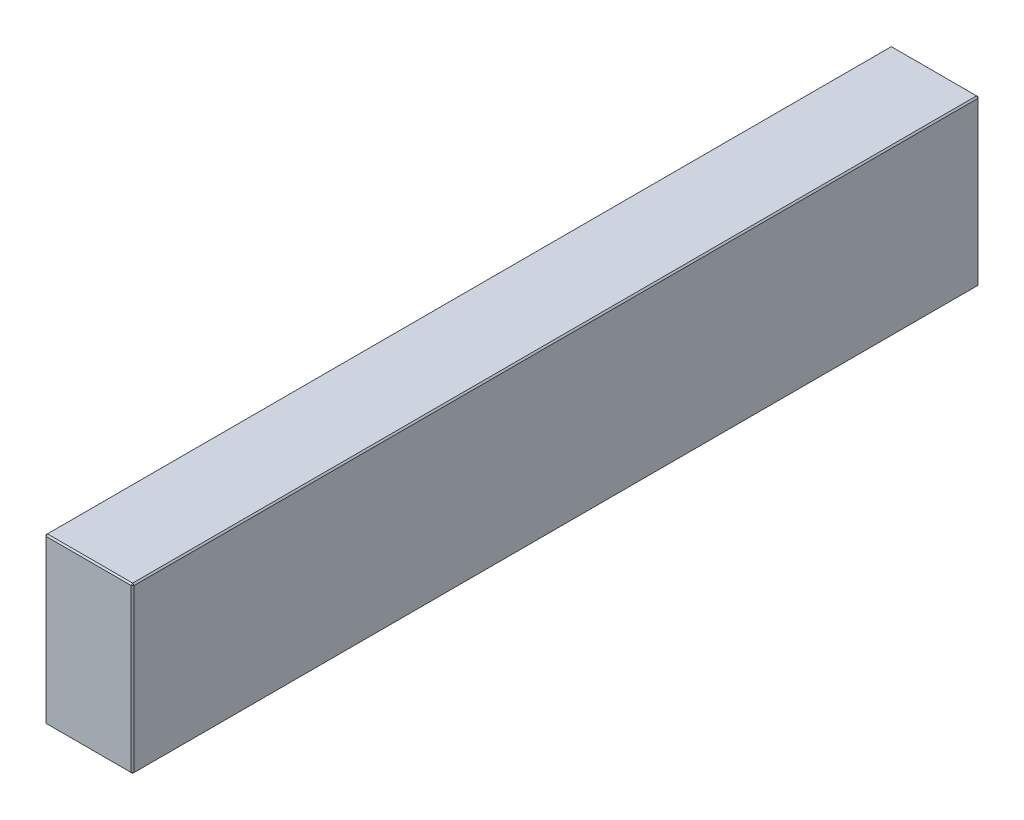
ISO-10303-21;
HEADER;
FILE_DESCRIPTION(('STEP AP214'),'2;1');
FILE_NAME('part.step','',(''),(''),'','','');
FILE_SCHEMA(('AUTOMOTIVE_DESIGN { 1 0 10303 214 1 1 1 1 }'));
ENDSEC;
DATA;
#1=APPLICATION_CONTEXT('core data for automotive mechanical design processes');
#2=APPLICATION_PROTOCOL_DEFINITION('international standard','automotive_design',2000,#1);
#3=PRODUCT_CONTEXT('',#1,'mechanical');
#4=PRODUCT('Part','Part','',(#3));
#5=PRODUCT_RELATED_PRODUCT_CATEGORY('part','',(#4));
#6=PRODUCT_DEFINITION_FORMATION('','',#4);
#7=PRODUCT_DEFINITION_CONTEXT('part definition',#1,'design');
#8=PRODUCT_DEFINITION('design','',#6,#7);
#9=PRODUCT_DEFINITION_SHAPE('','',#8);
#10=(LENGTH_UNIT() NAMED_UNIT(*) SI_UNIT(.MILLI.,.METRE.));
#11=(NAMED_UNIT(*) PLANE_ANGLE_UNIT() SI_UNIT($,.RADIAN.));
#12=(NAMED_UNIT(*) SI_UNIT($,.STERADIAN.) SOLID_ANGLE_UNIT());
#13=UNCERTAINTY_MEASURE_WITH_UNIT(LENGTH_MEASURE(1.E-05),#10,'distance_accuracy_value','');
#14=(GEOMETRIC_REPRESENTATION_CONTEXT(3) GLOBAL_UNCERTAINTY_ASSIGNED_CONTEXT((#13)) GLOBAL_UNIT_ASSIGNED_CONTEXT((#10,
#11,#12)) REPRESENTATION_CONTEXT('',''));
#15=CARTESIAN_POINT('',(0.,0.,0.));
#16=DIRECTION('',(0.,0.,1.));
#17=DIRECTION('',(1.,0.,0.));
#18=AXIS2_PLACEMENT_3D('',#15,#16,#17);
#19=CARTESIAN_POINT('',(-31.,116.,298.));
#20=DIRECTION('',(1.,0.,0.));
#21=DIRECTION('',(0.,0.,-1.));
#22=AXIS2_PLACEMENT_3D('',#19,#20,#21);
#23=PLANE('',#22);
#24=DIRECTION('',(0.,-1.,0.));
#25=VECTOR('',#24,1.);
#26=CARTESIAN_POINT('',(-31.,116.,-297.));
#27=LINE('',#26,#25);
#28=CARTESIAN_POINT('',(-31.,115.,-297.));
#29=VERTEX_POINT('',#28);
#30=CARTESIAN_POINT('',(-31.,1.,-297.));
#31=VERTEX_POINT('',#30);
#32=EDGE_CURVE('E114',#29,#31,#27,.T.);
#33=ORIENTED_EDGE('',*,*,#32,.T.);
#34=DIRECTION('',(0.,0.,1.));
#35=VECTOR('',#34,1.);
#36=CARTESIAN_POINT('',(-31.,1.,298.));
#37=LINE('',#36,#35);
#38=CARTESIAN_POINT('',(-31.,1.,297.));
#39=VERTEX_POINT('',#38);
#40=EDGE_CURVE('E110',#31,#39,#37,.T.);
#41=ORIENTED_EDGE('',*,*,#40,.T.);
#42=DIRECTION('',(0.,1.,0.));
#43=VECTOR('',#42,1.);
#44=CARTESIAN_POINT('',(-31.,116.,297.));
#45=LINE('',#44,#43);
#46=CARTESIAN_POINT('',(-31.,115.,297.));
#47=VERTEX_POINT('',#46);
#48=EDGE_CURVE('E103',#39,#47,#45,.T.);
#49=ORIENTED_EDGE('',*,*,#48,.T.);
#50=DIRECTION('',(0.,0.,-1.));
#51=VECTOR('',#50,1.);
#52=CARTESIAN_POINT('',(-31.,115.,-298.));
#53=LINE('',#52,#51);
#54=EDGE_CURVE('E107',#47,#29,#53,.T.);
#55=ORIENTED_EDGE('',*,*,#54,.T.);
#56=EDGE_LOOP('',(#33,#41,#49,#55));
#57=FACE_BOUND('',#56,.T.);
#58=ADVANCED_FACE('F15',(#57),#23,.F.);
#59=CARTESIAN_POINT('',(31.,116.,298.));
#60=DIRECTION('',(0.,0.,-1.));
#61=DIRECTION('',(-1.,0.,0.));
#62=AXIS2_PLACEMENT_3D('',#59,#60,#61);
#63=PLANE('',#62);
#64=DIRECTION('',(-1.,0.,0.));
#65=VECTOR('',#64,1.);
#66=CARTESIAN_POINT('',(-31.,115.,298.));
#67=LINE('',#66,#65);
#68=CARTESIAN_POINT('',(30.,115.,298.));
#69=VERTEX_POINT('',#68);
#70=CARTESIAN_POINT('',(-30.,115.,298.));
#71=VERTEX_POINT('',#70);
#72=EDGE_CURVE('E164',#69,#71,#67,.T.);
#73=ORIENTED_EDGE('',*,*,#72,.T.);
#74=DIRECTION('',(0.,-1.,0.));
#75=VECTOR('',#74,1.);
#76=CARTESIAN_POINT('',(-30.,116.,298.));
#77=LINE('',#76,#75);
#78=CARTESIAN_POINT('',(-30.,1.,298.));
#79=VERTEX_POINT('',#78);
#80=EDGE_CURVE('E122',#71,#79,#77,.T.);
#81=ORIENTED_EDGE('',*,*,#80,.T.);
#82=DIRECTION('',(1.,0.,0.));
#83=VECTOR('',#82,1.);
#84=CARTESIAN_POINT('',(31.,1.,298.));
#85=LINE('',#84,#83);
#86=CARTESIAN_POINT('',(30.,1.,298.));
#87=VERTEX_POINT('',#86);
#88=EDGE_CURVE('E168',#79,#87,#85,.T.);
#89=ORIENTED_EDGE('',*,*,#88,.T.);
#90=DIRECTION('',(0.,1.,0.));
#91=VECTOR('',#90,1.);
#92=CARTESIAN_POINT('',(30.,116.,298.));
#93=LINE('',#92,#91);
#94=EDGE_CURVE('E166',#87,#69,#93,.T.);
#95=ORIENTED_EDGE('',*,*,#94,.T.);
#96=EDGE_LOOP('',(#73,#81,#89,#95));
#97=FACE_BOUND('',#96,.T.);
#98=ADVANCED_FACE('F275',(#97),#63,.F.);
#99=CARTESIAN_POINT('',(31.,116.,298.));
#100=DIRECTION('',(-1.,0.,0.));
#101=DIRECTION('',(0.,0.,1.));
#102=AXIS2_PLACEMENT_3D('',#99,#100,#101);
#103=PLANE('',#102);
#104=DIRECTION('',(0.,0.,-1.));
#105=VECTOR('',#104,1.);
#106=CARTESIAN_POINT('',(31.,1.,298.));
#107=LINE('',#106,#105);
#108=CARTESIAN_POINT('',(31.,1.,297.));
#109=VERTEX_POINT('',#108);
#110=CARTESIAN_POINT('',(31.,1.,-297.));
#111=VERTEX_POINT('',#110);
#112=EDGE_CURVE('E159',#109,#111,#107,.T.);
#113=ORIENTED_EDGE('',*,*,#112,.T.);
#114=DIRECTION('',(0.,1.,0.));
#115=VECTOR('',#114,1.);
#116=CARTESIAN_POINT('',(31.,116.,-297.));
#117=LINE('',#116,#115);
#118=CARTESIAN_POINT('',(31.,115.,-297.));
#119=VERTEX_POINT('',#118);
#120=EDGE_CURVE('E161',#111,#119,#117,.T.);
#121=ORIENTED_EDGE('',*,*,#120,.T.);
#122=DIRECTION('',(0.,0.,1.));
#123=VECTOR('',#122,1.);
#124=CARTESIAN_POINT('',(31.,115.,298.));
#125=LINE('',#124,#123);
#126=CARTESIAN_POINT('',(31.,115.,297.));
#127=VERTEX_POINT('',#126);
#128=EDGE_CURVE('E155',#119,#127,#125,.T.);
#129=ORIENTED_EDGE('',*,*,#128,.T.);
#130=DIRECTION('',(0.,-1.,0.));
#131=VECTOR('',#130,1.);
#132=CARTESIAN_POINT('',(31.,116.,297.));
#133=LINE('',#132,#131);
#134=EDGE_CURVE('E157',#127,#109,#133,.T.);
#135=ORIENTED_EDGE('',*,*,#134,.T.);
#136=EDGE_LOOP('',(#113,#121,#129,#135));
#137=FACE_BOUND('',#136,.T.);
#138=ADVANCED_FACE('F254',(#137),#103,.F.);
#139=CARTESIAN_POINT('',(31.,116.,-298.));
#140=DIRECTION('',(0.,0.,1.));
#141=DIRECTION('',(1.,0.,0.));
#142=AXIS2_PLACEMENT_3D('',#139,#140,#141);
#143=PLANE('',#142);
#144=DIRECTION('',(0.,-1.,0.));
#145=VECTOR('',#144,1.);
#146=CARTESIAN_POINT('',(30.,116.,-298.));
#147=LINE('',#146,#145);
#148=CARTESIAN_POINT('',(30.,115.,-298.));
#149=VERTEX_POINT('',#148);
#150=CARTESIAN_POINT('',(30.,1.,-298.));
#151=VERTEX_POINT('',#150);
#152=EDGE_CURVE('E148',#149,#151,#147,.T.);
#153=ORIENTED_EDGE('',*,*,#152,.T.);
#154=DIRECTION('',(-1.,0.,0.));
#155=VECTOR('',#154,1.);
#156=CARTESIAN_POINT('',(31.,1.,-298.));
#157=LINE('',#156,#155);
#158=CARTESIAN_POINT('',(-30.,1.,-298.));
#159=VERTEX_POINT('',#158);
#160=EDGE_CURVE('E153',#151,#159,#157,.T.);
#161=ORIENTED_EDGE('',*,*,#160,.T.);
#162=DIRECTION('',(0.,1.,0.));
#163=VECTOR('',#162,1.);
#164=CARTESIAN_POINT('',(-30.,116.,-298.));
#165=LINE('',#164,#163);
#166=CARTESIAN_POINT('',(-30.,115.,-298.));
#167=VERTEX_POINT('',#166);
#168=EDGE_CURVE('E150',#159,#167,#165,.T.);
#169=ORIENTED_EDGE('',*,*,#168,.T.);
#170=DIRECTION('',(1.,0.,0.));
#171=VECTOR('',#170,1.);
#172=CARTESIAN_POINT('',(31.,115.,-298.));
#173=LINE('',#172,#171);
#174=EDGE_CURVE('E146',#167,#149,#173,.T.);
#175=ORIENTED_EDGE('',*,*,#174,.T.);
#176=EDGE_LOOP('',(#153,#161,#169,#175));
#177=FACE_BOUND('',#176,.T.);
#178=ADVANCED_FACE('F284',(#177),#143,.F.);
#179=CARTESIAN_POINT('',(0.,116.,0.));
#180=DIRECTION('',(0.,1.,0.));
#181=DIRECTION('',(0.,0.,1.));
#182=AXIS2_PLACEMENT_3D('',#179,#180,#181);
#183=PLANE('',#182);
#184=DIRECTION('',(0.,0.,-1.));
#185=VECTOR('',#184,1.);
#186=CARTESIAN_POINT('',(30.,116.,-298.));
#187=LINE('',#186,#185);
#188=CARTESIAN_POINT('',(30.,116.,297.));
#189=VERTEX_POINT('',#188);
#190=CARTESIAN_POINT('',(30.,116.,-297.));
#191=VERTEX_POINT('',#190);
#192=EDGE_CURVE('E24',#189,#191,#187,.T.);
#193=ORIENTED_EDGE('',*,*,#192,.T.);
#194=DIRECTION('',(-1.,0.,0.));
#195=VECTOR('',#194,1.);
#196=CARTESIAN_POINT('',(-31.,116.,-297.));
#197=LINE('',#196,#195);
#198=CARTESIAN_POINT('',(-30.,116.,-297.));
#199=VERTEX_POINT('',#198);
#200=EDGE_CURVE('E9',#191,#199,#197,.T.);
#201=ORIENTED_EDGE('',*,*,#200,.T.);
#202=DIRECTION('',(0.,0.,1.));
#203=VECTOR('',#202,1.);
#204=CARTESIAN_POINT('',(-30.,116.,298.));
#205=LINE('',#204,#203);
#206=CARTESIAN_POINT('',(-30.,116.,297.));
#207=VERTEX_POINT('',#206);
#208=EDGE_CURVE('E180',#199,#207,#205,.T.);
#209=ORIENTED_EDGE('',*,*,#208,.T.);
#210=DIRECTION('',(1.,0.,0.));
#211=VECTOR('',#210,1.);
#212=CARTESIAN_POINT('',(31.,116.,297.));
#213=LINE('',#212,#211);
#214=EDGE_CURVE('E35',#207,#189,#213,.T.);
#215=ORIENTED_EDGE('',*,*,#214,.T.);
#216=EDGE_LOOP('',(#193,#201,#209,#215));
#217=FACE_BOUND('',#216,.T.);
#218=ADVANCED_FACE('F350',(#217),#183,.T.);
#219=CARTESIAN_POINT('',(0.,0.,0.));
#220=DIRECTION('',(0.,1.,0.));
#221=DIRECTION('',(0.,0.,1.));
#222=AXIS2_PLACEMENT_3D('',#219,#220,#221);
#223=PLANE('',#222);
#224=DIRECTION('',(0.,0.,1.));
#225=VECTOR('',#224,1.);
#226=CARTESIAN_POINT('',(30.,0.,0.));
#227=LINE('',#226,#225);
#228=CARTESIAN_POINT('',(30.,0.,-297.));
#229=VERTEX_POINT('',#228);
#230=CARTESIAN_POINT('',(30.,0.,297.));
#231=VERTEX_POINT('',#230);
#232=EDGE_CURVE('E171',#229,#231,#227,.T.);
#233=ORIENTED_EDGE('',*,*,#232,.T.);
#234=DIRECTION('',(-1.,0.,0.));
#235=VECTOR('',#234,1.);
#236=CARTESIAN_POINT('',(0.,0.,297.));
#237=LINE('',#236,#235);
#238=CARTESIAN_POINT('',(-30.,0.,297.));
#239=VERTEX_POINT('',#238);
#240=EDGE_CURVE('E177',#231,#239,#237,.T.);
#241=ORIENTED_EDGE('',*,*,#240,.T.);
#242=DIRECTION('',(0.,0.,-1.));
#243=VECTOR('',#242,1.);
#244=CARTESIAN_POINT('',(-30.,0.,0.));
#245=LINE('',#244,#243);
#246=CARTESIAN_POINT('',(-30.,0.,-297.));
#247=VERTEX_POINT('',#246);
#248=EDGE_CURVE('E175',#239,#247,#245,.T.);
#249=ORIENTED_EDGE('',*,*,#248,.T.);
#250=DIRECTION('',(1.,0.,0.));
#251=VECTOR('',#250,1.);
#252=CARTESIAN_POINT('',(0.,0.,-297.));
#253=LINE('',#252,#251);
#254=EDGE_CURVE('E173',#247,#229,#253,.T.);
#255=ORIENTED_EDGE('',*,*,#254,.T.);
#256=EDGE_LOOP('',(#233,#241,#249,#255));
#257=FACE_BOUND('',#256,.T.);
#258=ADVANCED_FACE('F246',(#257),#223,.F.);
#259=CARTESIAN_POINT('',(31.,116.,297.));
#260=DIRECTION('',(-0.707106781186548,0.,-0.707106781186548));
#261=DIRECTION('',(0.,-1.,0.));
#262=AXIS2_PLACEMENT_3D('',#259,#260,#261);
#263=PLANE('',#262);
#264=DIRECTION('',(-0.707106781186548,0.,0.707106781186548));
#265=VECTOR('',#264,1.);
#266=CARTESIAN_POINT('',(30.,115.,298.));
#267=LINE('',#266,#265);
#268=EDGE_CURVE('E19',#69,#127,#267,.F.);
#269=ORIENTED_EDGE('',*,*,#268,.F.);
#270=ORIENTED_EDGE('',*,*,#94,.F.);
#271=DIRECTION('',(0.707106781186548,0.,-0.707106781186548));
#272=VECTOR('',#271,1.);
#273=CARTESIAN_POINT('',(30.,1.,298.));
#274=LINE('',#273,#272);
#275=EDGE_CURVE('E142',#109,#87,#274,.F.);
#276=ORIENTED_EDGE('',*,*,#275,.F.);
#277=ORIENTED_EDGE('',*,*,#134,.F.);
#278=EDGE_LOOP('',(#269,#270,#276,#277));
#279=FACE_BOUND('',#278,.T.);
#280=ADVANCED_FACE('F17',(#279),#263,.F.);
#281=CARTESIAN_POINT('',(30.,115.,298.));
#282=DIRECTION('',(0.577350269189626,0.577350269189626,0.577350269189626));
#283=DIRECTION('',(0.707106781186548,0.,-0.707106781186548));
#284=AXIS2_PLACEMENT_3D('',#281,#282,#283);
#285=PLANE('',#284);
#286=DIRECTION('',(0.,-0.707106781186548,0.707106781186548));
#287=VECTOR('',#286,1.);
#288=CARTESIAN_POINT('',(30.,115.,298.));
#289=LINE('',#288,#287);
#290=EDGE_CURVE('E226',#69,#189,#289,.F.);
#291=ORIENTED_EDGE('',*,*,#290,.F.);
#292=ORIENTED_EDGE('',*,*,#268,.T.);
#293=DIRECTION('',(-0.707106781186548,0.707106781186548,0.));
#294=VECTOR('',#293,1.);
#295=CARTESIAN_POINT('',(30.5,115.5,297.));
#296=LINE('',#295,#294);
#297=EDGE_CURVE('E228',#189,#127,#296,.F.);
#298=ORIENTED_EDGE('',*,*,#297,.F.);
#299=EDGE_LOOP('',(#291,#292,#298));
#300=FACE_BOUND('',#299,.T.);
#301=ADVANCED_FACE('F270',(#300),#285,.T.);
#302=CARTESIAN_POINT('',(30.,1.,298.));
#303=DIRECTION('',(0.577350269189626,-0.577350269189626,0.577350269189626));
#304=DIRECTION('',(0.707106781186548,0.,-0.707106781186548));
#305=AXIS2_PLACEMENT_3D('',#302,#303,#304);
#306=PLANE('',#305);
#307=DIRECTION('',(-0.707106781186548,-0.707106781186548,0.));
#308=VECTOR('',#307,1.);
#309=CARTESIAN_POINT('',(30.5,0.5,297.));
#310=LINE('',#309,#308);
#311=EDGE_CURVE('E220',#109,#231,#310,.T.);
#312=ORIENTED_EDGE('',*,*,#311,.F.);
#313=ORIENTED_EDGE('',*,*,#275,.T.);
#314=DIRECTION('',(0.,0.707106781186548,0.707106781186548));
#315=VECTOR('',#314,1.);
#316=CARTESIAN_POINT('',(30.,1.,298.));
#317=LINE('',#316,#315);
#318=EDGE_CURVE('E223',#231,#87,#317,.T.);
#319=ORIENTED_EDGE('',*,*,#318,.F.);
#320=EDGE_LOOP('',(#312,#313,#319));
#321=FACE_BOUND('',#320,.T.);
#322=ADVANCED_FACE('F235',(#321),#306,.T.);
#323=CARTESIAN_POINT('',(30.,116.,0.));
#324=DIRECTION('',(0.707106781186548,0.707106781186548,0.));
#325=DIRECTION('',(0.,0.,1.));
#326=AXIS2_PLACEMENT_3D('',#323,#324,#325);
#327=PLANE('',#326);
#328=ORIENTED_EDGE('',*,*,#297,.T.);
#329=ORIENTED_EDGE('',*,*,#128,.F.);
#330=DIRECTION('',(0.707106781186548,-0.707106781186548,0.));
#331=VECTOR('',#330,1.);
#332=CARTESIAN_POINT('',(31.,115.,-297.));
#333=LINE('',#332,#331);
#334=EDGE_CURVE('E215',#191,#119,#333,.T.);
#335=ORIENTED_EDGE('',*,*,#334,.F.);
#336=ORIENTED_EDGE('',*,*,#192,.F.);
#337=EDGE_LOOP('',(#328,#329,#335,#336));
#338=FACE_BOUND('',#337,.T.);
#339=ADVANCED_FACE('F265',(#338),#327,.T.);
#340=CARTESIAN_POINT('',(0.,116.,297.));
#341=DIRECTION('',(0.,0.707106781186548,0.707106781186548));
#342=DIRECTION('',(-1.,0.,0.));
#343=AXIS2_PLACEMENT_3D('',#340,#341,#342);
#344=PLANE('',#343);
#345=ORIENTED_EDGE('',*,*,#290,.T.);
#346=ORIENTED_EDGE('',*,*,#214,.F.);
#347=DIRECTION('',(0.,0.707106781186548,-0.707106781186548));
#348=VECTOR('',#347,1.);
#349=CARTESIAN_POINT('',(-30.,115.5,297.5));
#350=LINE('',#349,#348);
#351=EDGE_CURVE('E126',#71,#207,#350,.T.);
#352=ORIENTED_EDGE('',*,*,#351,.F.);
#353=ORIENTED_EDGE('',*,*,#72,.F.);
#354=EDGE_LOOP('',(#345,#346,#352,#353));
#355=FACE_BOUND('',#354,.T.);
#356=ADVANCED_FACE('F273',(#355),#344,.T.);
#357=CARTESIAN_POINT('',(-30.,116.,298.));
#358=DIRECTION('',(0.707106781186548,0.,-0.707106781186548));
#359=DIRECTION('',(0.,-1.,0.));
#360=AXIS2_PLACEMENT_3D('',#357,#358,#359);
#361=PLANE('',#360);
#362=DIRECTION('',(0.707106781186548,0.,0.707106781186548));
#363=VECTOR('',#362,1.);
#364=CARTESIAN_POINT('',(-30.,1.,298.));
#365=LINE('',#364,#363);
#366=EDGE_CURVE('E127',#79,#39,#365,.F.);
#367=ORIENTED_EDGE('',*,*,#366,.F.);
#368=ORIENTED_EDGE('',*,*,#80,.F.);
#369=DIRECTION('',(-0.707106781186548,0.,-0.707106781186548));
#370=VECTOR('',#369,1.);
#371=CARTESIAN_POINT('',(-31.,115.,297.));
#372=LINE('',#371,#370);
#373=EDGE_CURVE('E118',#47,#71,#372,.F.);
#374=ORIENTED_EDGE('',*,*,#373,.F.);
#375=ORIENTED_EDGE('',*,*,#48,.F.);
#376=EDGE_LOOP('',(#367,#368,#374,#375));
#377=FACE_BOUND('',#376,.T.);
#378=ADVANCED_FACE('F120',(#377),#361,.F.);
#379=CARTESIAN_POINT('',(31.,1.,298.));
#380=DIRECTION('',(0.,0.707106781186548,-0.707106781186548));
#381=DIRECTION('',(1.,0.,0.));
#382=AXIS2_PLACEMENT_3D('',#379,#380,#381);
#383=PLANE('',#382);
#384=ORIENTED_EDGE('',*,*,#318,.T.);
#385=ORIENTED_EDGE('',*,*,#88,.F.);
#386=DIRECTION('',(0.,-0.707106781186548,-0.707106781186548));
#387=VECTOR('',#386,1.);
#388=CARTESIAN_POINT('',(-30.,1.,298.));
#389=LINE('',#388,#387);
#390=EDGE_CURVE('E211',#239,#79,#389,.F.);
#391=ORIENTED_EDGE('',*,*,#390,.F.);
#392=ORIENTED_EDGE('',*,*,#240,.F.);
#393=EDGE_LOOP('',(#384,#385,#391,#392));
#394=FACE_BOUND('',#393,.T.);
#395=ADVANCED_FACE('F243',(#394),#383,.F.);
#396=CARTESIAN_POINT('',(31.,1.,298.));
#397=DIRECTION('',(-0.707106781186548,0.707106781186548,0.));
#398=DIRECTION('',(0.,0.,-1.));
#399=AXIS2_PLACEMENT_3D('',#396,#397,#398);
#400=PLANE('',#399);
#401=ORIENTED_EDGE('',*,*,#311,.T.);
#402=ORIENTED_EDGE('',*,*,#232,.F.);
#403=DIRECTION('',(0.707106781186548,0.707106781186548,0.));
#404=VECTOR('',#403,1.);
#405=CARTESIAN_POINT('',(30.5,0.499999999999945,-297.));
#406=LINE('',#405,#404);
#407=EDGE_CURVE('E208',#111,#229,#406,.F.);
#408=ORIENTED_EDGE('',*,*,#407,.F.);
#409=ORIENTED_EDGE('',*,*,#112,.F.);
#410=EDGE_LOOP('',(#401,#402,#408,#409));
#411=FACE_BOUND('',#410,.T.);
#412=ADVANCED_FACE('F251',(#411),#400,.F.);
#413=CARTESIAN_POINT('',(30.,116.,-298.));
#414=DIRECTION('',(-0.707106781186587,0.,0.707106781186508));
#415=DIRECTION('',(0.,-1.,0.));
#416=AXIS2_PLACEMENT_3D('',#413,#414,#415);
#417=PLANE('',#416);
#418=DIRECTION('',(0.707106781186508,0.,0.707106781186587));
#419=VECTOR('',#418,1.);
#420=CARTESIAN_POINT('',(31.,115.,-297.));
#421=LINE('',#420,#419);
#422=EDGE_CURVE('E217',#119,#149,#421,.F.);
#423=ORIENTED_EDGE('',*,*,#422,.F.);
#424=ORIENTED_EDGE('',*,*,#120,.F.);
#425=DIRECTION('',(-0.707106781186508,0.,-0.707106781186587));
#426=VECTOR('',#425,1.);
#427=CARTESIAN_POINT('',(30.,1.,-298.));
#428=LINE('',#427,#426);
#429=EDGE_CURVE('E205',#151,#111,#428,.F.);
#430=ORIENTED_EDGE('',*,*,#429,.F.);
#431=ORIENTED_EDGE('',*,*,#152,.F.);
#432=EDGE_LOOP('',(#423,#424,#430,#431));
#433=FACE_BOUND('',#432,.T.);
#434=ADVANCED_FACE('F258',(#433),#417,.F.);
#435=CARTESIAN_POINT('',(31.,115.,-297.));
#436=DIRECTION('',(0.577350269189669,0.577350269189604,-0.577350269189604));
#437=DIRECTION('',(-0.707106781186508,0.,-0.707106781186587));
#438=AXIS2_PLACEMENT_3D('',#435,#436,#437);
#439=PLANE('',#438);
#440=ORIENTED_EDGE('',*,*,#334,.T.);
#441=ORIENTED_EDGE('',*,*,#422,.T.);
#442=DIRECTION('',(0.,0.707106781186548,0.707106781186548));
#443=VECTOR('',#442,1.);
#444=CARTESIAN_POINT('',(30.,115.5,-297.5));
#445=LINE('',#444,#443);
#446=EDGE_CURVE('E134',#191,#149,#445,.F.);
#447=ORIENTED_EDGE('',*,*,#446,.F.);
#448=EDGE_LOOP('',(#440,#441,#447));
#449=FACE_BOUND('',#448,.T.);
#450=ADVANCED_FACE('F325',(#449),#439,.T.);
#451=CARTESIAN_POINT('',(-31.,115.,297.));
#452=DIRECTION('',(-0.577350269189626,0.577350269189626,0.577350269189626));
#453=DIRECTION('',(0.707106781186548,0.,0.707106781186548));
#454=AXIS2_PLACEMENT_3D('',#451,#452,#453);
#455=PLANE('',#454);
#456=ORIENTED_EDGE('',*,*,#373,.T.);
#457=ORIENTED_EDGE('',*,*,#351,.T.);
#458=DIRECTION('',(-0.707106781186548,-0.707106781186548,0.));
#459=VECTOR('',#458,1.);
#460=CARTESIAN_POINT('',(-31.,115.,297.));
#461=LINE('',#460,#459);
#462=EDGE_CURVE('E130',#47,#207,#461,.F.);
#463=ORIENTED_EDGE('',*,*,#462,.F.);
#464=EDGE_LOOP('',(#456,#457,#463));
#465=FACE_BOUND('',#464,.T.);
#466=ADVANCED_FACE('F131',(#465),#455,.T.);
#467=CARTESIAN_POINT('',(-30.,1.,298.));
#468=DIRECTION('',(-0.577350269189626,-0.577350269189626,0.577350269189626));
#469=DIRECTION('',(0.707106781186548,0.,0.707106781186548));
#470=AXIS2_PLACEMENT_3D('',#467,#468,#469);
#471=PLANE('',#470);
#472=ORIENTED_EDGE('',*,*,#390,.T.);
#473=ORIENTED_EDGE('',*,*,#366,.T.);
#474=DIRECTION('',(-0.707106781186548,0.707106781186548,0.));
#475=VECTOR('',#474,1.);
#476=CARTESIAN_POINT('',(-30.5,0.5,297.));
#477=LINE('',#476,#475);
#478=EDGE_CURVE('E135',#239,#39,#477,.T.);
#479=ORIENTED_EDGE('',*,*,#478,.F.);
#480=EDGE_LOOP('',(#472,#473,#479));
#481=FACE_BOUND('',#480,.T.);
#482=ADVANCED_FACE('F318',(#481),#471,.T.);
#483=CARTESIAN_POINT('',(30.,1.,-298.));
#484=DIRECTION('',(0.577350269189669,-0.577350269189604,-0.577350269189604));
#485=DIRECTION('',(-0.707106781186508,0.,-0.707106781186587));
#486=AXIS2_PLACEMENT_3D('',#483,#484,#485);
#487=PLANE('',#486);
#488=ORIENTED_EDGE('',*,*,#429,.T.);
#489=ORIENTED_EDGE('',*,*,#407,.T.);
#490=DIRECTION('',(0.,-0.707106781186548,0.707106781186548));
#491=VECTOR('',#490,1.);
#492=CARTESIAN_POINT('',(30.,1.,-298.));
#493=LINE('',#492,#491);
#494=EDGE_CURVE('E198',#151,#229,#493,.T.);
#495=ORIENTED_EDGE('',*,*,#494,.F.);
#496=EDGE_LOOP('',(#488,#489,#495));
#497=FACE_BOUND('',#496,.T.);
#498=ADVANCED_FACE('F314',(#497),#487,.T.);
#499=CARTESIAN_POINT('',(0.,116.,-297.));
#500=DIRECTION('',(0.,0.707106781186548,-0.707106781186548));
#501=DIRECTION('',(1.,0.,0.));
#502=AXIS2_PLACEMENT_3D('',#499,#500,#501);
#503=PLANE('',#502);
#504=ORIENTED_EDGE('',*,*,#446,.T.);
#505=ORIENTED_EDGE('',*,*,#174,.F.);
#506=DIRECTION('',(0.,-0.707106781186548,-0.707106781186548));
#507=VECTOR('',#506,1.);
#508=CARTESIAN_POINT('',(-30.,115.,-298.));
#509=LINE('',#508,#507);
#510=EDGE_CURVE('E195',#199,#167,#509,.T.);
#511=ORIENTED_EDGE('',*,*,#510,.F.);
#512=ORIENTED_EDGE('',*,*,#200,.F.);
#513=EDGE_LOOP('',(#504,#505,#511,#512));
#514=FACE_BOUND('',#513,.T.);
#515=ADVANCED_FACE('F311',(#514),#503,.T.);
#516=CARTESIAN_POINT('',(-30.,116.,0.));
#517=DIRECTION('',(-0.707106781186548,0.707106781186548,0.));
#518=DIRECTION('',(0.,0.,-1.));
#519=AXIS2_PLACEMENT_3D('',#516,#517,#518);
#520=PLANE('',#519);
#521=ORIENTED_EDGE('',*,*,#462,.T.);
#522=ORIENTED_EDGE('',*,*,#208,.F.);
#523=DIRECTION('',(0.707106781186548,0.707106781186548,0.));
#524=VECTOR('',#523,1.);
#525=CARTESIAN_POINT('',(-30.5,115.5,-297.));
#526=LINE('',#525,#524);
#527=EDGE_CURVE('E138',#29,#199,#526,.T.);
#528=ORIENTED_EDGE('',*,*,#527,.F.);
#529=ORIENTED_EDGE('',*,*,#54,.F.);
#530=EDGE_LOOP('',(#521,#522,#528,#529));
#531=FACE_BOUND('',#530,.T.);
#532=ADVANCED_FACE('F137',(#531),#520,.T.);
#533=CARTESIAN_POINT('',(-31.,1.,298.));
#534=DIRECTION('',(0.707106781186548,0.707106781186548,0.));
#535=DIRECTION('',(0.,0.,1.));
#536=AXIS2_PLACEMENT_3D('',#533,#534,#535);
#537=PLANE('',#536);
#538=ORIENTED_EDGE('',*,*,#478,.T.);
#539=ORIENTED_EDGE('',*,*,#40,.F.);
#540=DIRECTION('',(0.707106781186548,-0.707106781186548,0.));
#541=VECTOR('',#540,1.);
#542=CARTESIAN_POINT('',(-31.,1.,-297.));
#543=LINE('',#542,#541);
#544=EDGE_CURVE('E191',#247,#31,#543,.F.);
#545=ORIENTED_EDGE('',*,*,#544,.F.);
#546=ORIENTED_EDGE('',*,*,#248,.F.);
#547=EDGE_LOOP('',(#538,#539,#545,#546));
#548=FACE_BOUND('',#547,.T.);
#549=ADVANCED_FACE('F304',(#548),#537,.F.);
#550=CARTESIAN_POINT('',(31.,1.,-298.));
#551=DIRECTION('',(0.,0.707106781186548,0.707106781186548));
#552=DIRECTION('',(-1.,0.,0.));
#553=AXIS2_PLACEMENT_3D('',#550,#551,#552);
#554=PLANE('',#553);
#555=ORIENTED_EDGE('',*,*,#494,.T.);
#556=ORIENTED_EDGE('',*,*,#254,.F.);
#557=DIRECTION('',(0.,0.707106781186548,-0.707106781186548));
#558=VECTOR('',#557,1.);
#559=CARTESIAN_POINT('',(-30.,0.499999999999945,-297.5));
#560=LINE('',#559,#558);
#561=EDGE_CURVE('E188',#159,#247,#560,.F.);
#562=ORIENTED_EDGE('',*,*,#561,.F.);
#563=ORIENTED_EDGE('',*,*,#160,.F.);
#564=EDGE_LOOP('',(#555,#556,#562,#563));
#565=FACE_BOUND('',#564,.T.);
#566=ADVANCED_FACE('F300',(#565),#554,.F.);
#567=CARTESIAN_POINT('',(-30.,115.,-298.));
#568=DIRECTION('',(-0.577350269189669,0.577350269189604,-0.577350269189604));
#569=DIRECTION('',(-0.707106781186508,0.,0.707106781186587));
#570=AXIS2_PLACEMENT_3D('',#567,#568,#569);
#571=PLANE('',#570);
#572=ORIENTED_EDGE('',*,*,#527,.T.);
#573=ORIENTED_EDGE('',*,*,#510,.T.);
#574=DIRECTION('',(0.707106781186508,0.,-0.707106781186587));
#575=VECTOR('',#574,1.);
#576=CARTESIAN_POINT('',(-30.,115.,-298.));
#577=LINE('',#576,#575);
#578=EDGE_CURVE('E186',#29,#167,#577,.T.);
#579=ORIENTED_EDGE('',*,*,#578,.F.);
#580=EDGE_LOOP('',(#572,#573,#579));
#581=FACE_BOUND('',#580,.T.);
#582=ADVANCED_FACE('F296',(#581),#571,.T.);
#583=CARTESIAN_POINT('',(-31.,1.,-297.));
#584=DIRECTION('',(-0.577350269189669,-0.577350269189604,-0.577350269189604));
#585=DIRECTION('',(-0.707106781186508,0.,0.707106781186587));
#586=AXIS2_PLACEMENT_3D('',#583,#584,#585);
#587=PLANE('',#586);
#588=ORIENTED_EDGE('',*,*,#561,.T.);
#589=ORIENTED_EDGE('',*,*,#544,.T.);
#590=DIRECTION('',(-0.707106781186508,0.,0.707106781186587));
#591=VECTOR('',#590,1.);
#592=CARTESIAN_POINT('',(-31.,1.,-297.));
#593=LINE('',#592,#591);
#594=EDGE_CURVE('E184',#159,#31,#593,.T.);
#595=ORIENTED_EDGE('',*,*,#594,.F.);
#596=EDGE_LOOP('',(#588,#589,#595));
#597=FACE_BOUND('',#596,.T.);
#598=ADVANCED_FACE('F292',(#597),#587,.T.);
#599=CARTESIAN_POINT('',(-31.,116.,-297.));
#600=DIRECTION('',(0.707106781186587,0.,0.707106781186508));
#601=DIRECTION('',(0.,-1.,0.));
#602=AXIS2_PLACEMENT_3D('',#599,#600,#601);
#603=PLANE('',#602);
#604=ORIENTED_EDGE('',*,*,#578,.T.);
#605=ORIENTED_EDGE('',*,*,#168,.F.);
#606=ORIENTED_EDGE('',*,*,#594,.T.);
#607=ORIENTED_EDGE('',*,*,#32,.F.);
#608=EDGE_LOOP('',(#604,#605,#606,#607));
#609=FACE_BOUND('',#608,.T.);
#610=ADVANCED_FACE('F289',(#609),#603,.F.);
#611=CLOSED_SHELL('',(#58,#98,#138,#178,#218,#258,#280,#301,#322,#339,#356,#378,#395,#412,#434,
#450,#466,#482,#498,#515,#532,#549,#566,#582,#598,#610));
#612=MANIFOLD_SOLID_BREP('B1',#611);
#613=ADVANCED_BREP_SHAPE_REPRESENTATION('',(#18,#612),#14);
#614=SHAPE_DEFINITION_REPRESENTATION(#9,#613);
ENDSEC;
END-ISO-10303-21;
